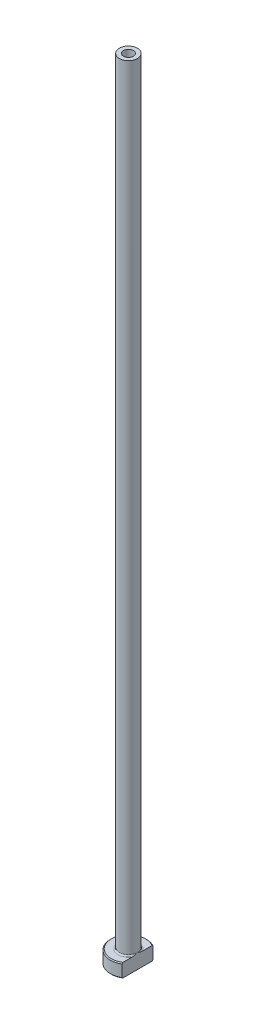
from build123d import *

# Parameters (mm, degrees)
FILLET1_R          = 0.3
CHAMFER1_SIZE      = 0.2
CUT_EXTRUDE1_DEPTH = 176.091404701
CHAMFER2_SIZE      = 0.5


with BuildPart() as part:
    # Sketch1 → Revolve1 (revolve)
    with BuildSketch(Plane.XY, mode=Mode.PRIVATE) as revolve1_sk:
        Polygon((-1.1, 175), (-2, 175), (-2, 3), (-4, 3), (-4, 0), (-1.35, 0), (-1.35, 128), (-1.1, 140), align=None)
    revolve(revolve1_sk.sketch.rotate(Axis((0, 92.187680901, 0), (0, -1, 0)), 270), axis=Axis((0, 92.187680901, 0), (0, -1, 0)))

    # Fillet1
    fillet1_edges = [part.edges().sort_by_distance(p)[0] for p in [
        (0, 3, -2),
    ]]
    fillet(fillet1_edges, radius=FILLET1_R)

    # Chamfer1
    chamfer1_edges = [part.edges().sort_by_distance(p)[0] for p in [
        (0, 0, -4),
        (0, 3, -4),
    ]]
    chamfer(chamfer1_edges, length=CHAMFER1_SIZE)

    # Sketch2 → Cut-Extrude1 (cut, through all)
    with BuildSketch(Plane.XZ):
        with BuildLine():
            Line((2, 3.464101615), (2, -3.464101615))
            ThreePointArc((2, -3.464101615), (4, 0), (2, 3.464101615))
        make_face()
    extrude(amount=-CUT_EXTRUDE1_DEPTH, mode=Mode.SUBTRACT)

    # Chamfer2
    chamfer2_edges = [part.edges().sort_by_distance(p)[0] for p in [
        (0, 0, -1.35),
    ]]
    chamfer(chamfer2_edges, length=CHAMFER2_SIZE)


solid = part.part
